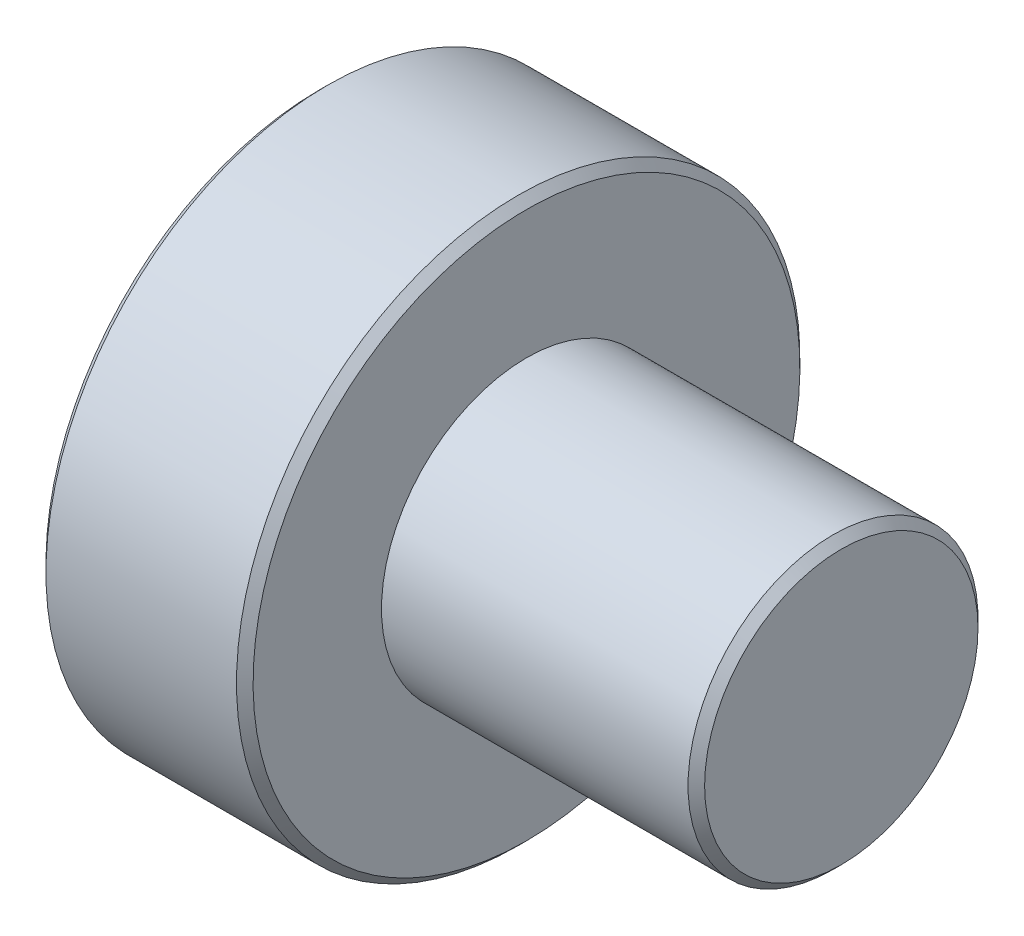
from build123d import *

# Parameters (mm, degrees)
CHANFREIN1_SIZE = 0.1


with BuildPart() as part:
    # Esquisse1 → R_volution1 (revolve)
    with BuildSketch(Plane.XY, mode=Mode.PRIVATE) as r_volution1_sk:
        Polygon((-3.15, 0), (3.15, 0), (3.15, 1.75), (-0.65, 1.75), (-0.65, 3.4), (-3.15, 3.4), align=None)
    revolve(r_volution1_sk.sketch.rotate(Axis((-3.15, 0, 0), (1, 0, 0)), 180), axis=Axis((-3.15, 0, 0), (1, 0, 0)))

    # Chanfrein1
    chanfrein1_edges = [part.edges().sort_by_distance(p)[0] for p in [
        (3.15, 1.75, 0),
        (-0.65, 3.4, 0),
        (-3.15, 3.4, 0),
    ]]
    chamfer(chanfrein1_edges, length=CHANFREIN1_SIZE)


solid = part.part
